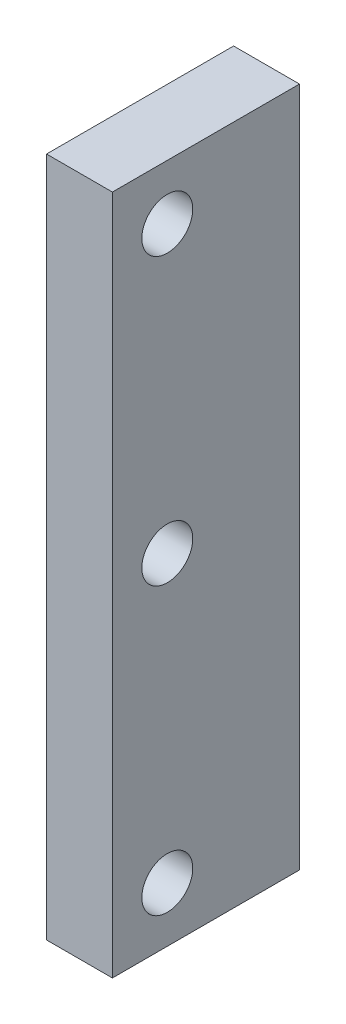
ISO-10303-21;
HEADER;
FILE_DESCRIPTION(('STEP AP214'),'2;1');
FILE_NAME('part.step','',(''),(''),'','','');
FILE_SCHEMA(('AUTOMOTIVE_DESIGN { 1 0 10303 214 1 1 1 1 }'));
ENDSEC;
DATA;
#1=APPLICATION_CONTEXT('core data for automotive mechanical design processes');
#2=APPLICATION_PROTOCOL_DEFINITION('international standard','automotive_design',2000,#1);
#3=PRODUCT_CONTEXT('',#1,'mechanical');
#4=PRODUCT('Part','Part','',(#3));
#5=PRODUCT_RELATED_PRODUCT_CATEGORY('part','',(#4));
#6=PRODUCT_DEFINITION_FORMATION('','',#4);
#7=PRODUCT_DEFINITION_CONTEXT('part definition',#1,'design');
#8=PRODUCT_DEFINITION('design','',#6,#7);
#9=PRODUCT_DEFINITION_SHAPE('','',#8);
#10=(LENGTH_UNIT() NAMED_UNIT(*) SI_UNIT(.MILLI.,.METRE.));
#11=(NAMED_UNIT(*) PLANE_ANGLE_UNIT() SI_UNIT($,.RADIAN.));
#12=(NAMED_UNIT(*) SI_UNIT($,.STERADIAN.) SOLID_ANGLE_UNIT());
#13=UNCERTAINTY_MEASURE_WITH_UNIT(LENGTH_MEASURE(1.E-05),#10,'distance_accuracy_value','');
#14=(GEOMETRIC_REPRESENTATION_CONTEXT(3) GLOBAL_UNCERTAINTY_ASSIGNED_CONTEXT((#13)) GLOBAL_UNIT_ASSIGNED_CONTEXT((#10,
#11,#12)) REPRESENTATION_CONTEXT('',''));
#15=CARTESIAN_POINT('',(0.,0.,0.));
#16=DIRECTION('',(0.,0.,1.));
#17=DIRECTION('',(1.,0.,0.));
#18=AXIS2_PLACEMENT_3D('',#15,#16,#17);
#19=CARTESIAN_POINT('',(0.,39.37,0.));
#20=DIRECTION('',(1.,0.,0.));
#21=DIRECTION('',(0.,0.,-1.));
#22=AXIS2_PLACEMENT_3D('',#19,#20,#21);
#23=PLANE('',#22);
#24=CARTESIAN_POINT('',(0.,19.685,-3.175));
#25=DIRECTION('',(-1.,0.,0.));
#26=DIRECTION('',(0.,0.,1.));
#27=AXIS2_PLACEMENT_3D('',#24,#25,#26);
#28=CIRCLE('',#27,1.47319999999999);
#29=CARTESIAN_POINT('',(0.,19.685,-1.70180000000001));
#30=VERTEX_POINT('',#29);
#31=EDGE_CURVE('E155',#30,#30,#28,.T.);
#32=ORIENTED_EDGE('',*,*,#31,.F.);
#33=EDGE_LOOP('',(#32));
#34=FACE_BOUND('',#33,.T.);
#35=CARTESIAN_POINT('',(0.,3.17499999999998,-3.17500000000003));
#36=DIRECTION('',(-1.,0.,0.));
#37=DIRECTION('',(0.,0.,1.));
#38=AXIS2_PLACEMENT_3D('',#35,#36,#37);
#39=CIRCLE('',#38,1.47319999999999);
#40=CARTESIAN_POINT('',(0.,3.17499999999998,-1.70180000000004));
#41=VERTEX_POINT('',#40);
#42=EDGE_CURVE('E96',#41,#41,#39,.T.);
#43=ORIENTED_EDGE('',*,*,#42,.F.);
#44=EDGE_LOOP('',(#43));
#45=FACE_BOUND('',#44,.T.);
#46=DIRECTION('',(0.,0.,1.));
#47=VECTOR('',#46,1.);
#48=CARTESIAN_POINT('',(0.,0.,0.));
#49=LINE('',#48,#47);
#50=CARTESIAN_POINT('',(0.,0.,-10.8204));
#51=VERTEX_POINT('',#50);
#52=CARTESIAN_POINT('',(0.,0.,0.));
#53=VERTEX_POINT('',#52);
#54=EDGE_CURVE('E76',#51,#53,#49,.T.);
#55=ORIENTED_EDGE('',*,*,#54,.T.);
#56=DIRECTION('',(0.,-1.,0.));
#57=VECTOR('',#56,1.);
#58=CARTESIAN_POINT('',(0.,39.37,0.));
#59=LINE('',#58,#57);
#60=CARTESIAN_POINT('',(0.,39.37,0.));
#61=VERTEX_POINT('',#60);
#62=EDGE_CURVE('E83',#61,#53,#59,.T.);
#63=ORIENTED_EDGE('',*,*,#62,.F.);
#64=DIRECTION('',(0.,0.,1.));
#65=VECTOR('',#64,1.);
#66=CARTESIAN_POINT('',(0.,39.37,0.));
#67=LINE('',#66,#65);
#68=CARTESIAN_POINT('',(0.,39.37,-10.8204));
#69=VERTEX_POINT('',#68);
#70=EDGE_CURVE('E103',#69,#61,#67,.T.);
#71=ORIENTED_EDGE('',*,*,#70,.F.);
#72=DIRECTION('',(0.,-1.,0.));
#73=VECTOR('',#72,1.);
#74=CARTESIAN_POINT('',(0.,39.37,-10.8204));
#75=LINE('',#74,#73);
#76=EDGE_CURVE('E92',#69,#51,#75,.T.);
#77=ORIENTED_EDGE('',*,*,#76,.T.);
#78=EDGE_LOOP('',(#55,#63,#71,#77));
#79=FACE_BOUND('',#78,.T.);
#80=CARTESIAN_POINT('',(0.,36.195,-3.175));
#81=DIRECTION('',(-1.,0.,0.));
#82=DIRECTION('',(0.,0.,1.));
#83=AXIS2_PLACEMENT_3D('',#80,#81,#82);
#84=CIRCLE('',#83,1.47319999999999);
#85=CARTESIAN_POINT('',(0.,36.195,-1.70180000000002));
#86=VERTEX_POINT('',#85);
#87=EDGE_CURVE('E11',#86,#86,#84,.T.);
#88=ORIENTED_EDGE('',*,*,#87,.F.);
#89=EDGE_LOOP('',(#88));
#90=FACE_BOUND('',#89,.T.);
#91=ADVANCED_FACE('F30',(#34,#45,#79,#90),#23,.F.);
#92=CARTESIAN_POINT('',(0.,39.37,0.));
#93=DIRECTION('',(0.,0.,-1.));
#94=DIRECTION('',(-1.,0.,0.));
#95=AXIS2_PLACEMENT_3D('',#92,#93,#94);
#96=PLANE('',#95);
#97=DIRECTION('',(1.,0.,0.));
#98=VECTOR('',#97,1.);
#99=CARTESIAN_POINT('',(0.,0.,0.));
#100=LINE('',#99,#98);
#101=CARTESIAN_POINT('',(3.81,0.,0.));
#102=VERTEX_POINT('',#101);
#103=EDGE_CURVE('E71',#53,#102,#100,.T.);
#104=ORIENTED_EDGE('',*,*,#103,.T.);
#105=DIRECTION('',(0.,-1.,0.));
#106=VECTOR('',#105,1.);
#107=CARTESIAN_POINT('',(3.81,39.37,0.));
#108=LINE('',#107,#106);
#109=CARTESIAN_POINT('',(3.81,39.37,0.));
#110=VERTEX_POINT('',#109);
#111=EDGE_CURVE('E88',#110,#102,#108,.T.);
#112=ORIENTED_EDGE('',*,*,#111,.F.);
#113=DIRECTION('',(1.,0.,0.));
#114=VECTOR('',#113,1.);
#115=CARTESIAN_POINT('',(0.,39.37,0.));
#116=LINE('',#115,#114);
#117=EDGE_CURVE('E85',#61,#110,#116,.T.);
#118=ORIENTED_EDGE('',*,*,#117,.F.);
#119=ORIENTED_EDGE('',*,*,#62,.T.);
#120=EDGE_LOOP('',(#104,#112,#118,#119));
#121=FACE_BOUND('',#120,.T.);
#122=ADVANCED_FACE('F84',(#121),#96,.F.);
#123=CARTESIAN_POINT('',(3.81,39.37,0.));
#124=DIRECTION('',(-1.,0.,0.));
#125=DIRECTION('',(0.,0.,1.));
#126=AXIS2_PLACEMENT_3D('',#123,#124,#125);
#127=PLANE('',#126);
#128=CARTESIAN_POINT('',(3.81,19.685,-3.175));
#129=DIRECTION('',(-1.,0.,0.));
#130=DIRECTION('',(0.,0.,1.));
#131=AXIS2_PLACEMENT_3D('',#128,#129,#130);
#132=CIRCLE('',#131,1.4732);
#133=CARTESIAN_POINT('',(3.81,19.685,-1.7018));
#134=VERTEX_POINT('',#133);
#135=EDGE_CURVE('E153',#134,#134,#132,.T.);
#136=ORIENTED_EDGE('',*,*,#135,.T.);
#137=EDGE_LOOP('',(#136));
#138=FACE_BOUND('',#137,.T.);
#139=CARTESIAN_POINT('',(3.80999999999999,3.17499999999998,-3.17500000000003));
#140=DIRECTION('',(-1.,0.,0.));
#141=DIRECTION('',(0.,0.,1.));
#142=AXIS2_PLACEMENT_3D('',#139,#140,#141);
#143=CIRCLE('',#142,1.4732);
#144=CARTESIAN_POINT('',(3.80999999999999,3.17499999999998,-1.70180000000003));
#145=VERTEX_POINT('',#144);
#146=EDGE_CURVE('E93',#145,#145,#143,.T.);
#147=ORIENTED_EDGE('',*,*,#146,.T.);
#148=EDGE_LOOP('',(#147));
#149=FACE_BOUND('',#148,.T.);
#150=DIRECTION('',(0.,0.,-1.));
#151=VECTOR('',#150,1.);
#152=CARTESIAN_POINT('',(3.81,0.,0.));
#153=LINE('',#152,#151);
#154=CARTESIAN_POINT('',(3.81,0.,-10.8204));
#155=VERTEX_POINT('',#154);
#156=EDGE_CURVE('E77',#102,#155,#153,.T.);
#157=ORIENTED_EDGE('',*,*,#156,.T.);
#158=DIRECTION('',(0.,-1.,0.));
#159=VECTOR('',#158,1.);
#160=CARTESIAN_POINT('',(3.81,39.37,-10.8204));
#161=LINE('',#160,#159);
#162=CARTESIAN_POINT('',(3.81,39.37,-10.8204));
#163=VERTEX_POINT('',#162);
#164=EDGE_CURVE('E109',#163,#155,#161,.T.);
#165=ORIENTED_EDGE('',*,*,#164,.F.);
#166=DIRECTION('',(0.,0.,-1.));
#167=VECTOR('',#166,1.);
#168=CARTESIAN_POINT('',(3.81,39.37,0.));
#169=LINE('',#168,#167);
#170=EDGE_CURVE('E50',#110,#163,#169,.T.);
#171=ORIENTED_EDGE('',*,*,#170,.F.);
#172=ORIENTED_EDGE('',*,*,#111,.T.);
#173=EDGE_LOOP('',(#157,#165,#171,#172));
#174=FACE_BOUND('',#173,.T.);
#175=CARTESIAN_POINT('',(3.81,36.195,-3.175));
#176=DIRECTION('',(-1.,0.,0.));
#177=DIRECTION('',(0.,0.,1.));
#178=AXIS2_PLACEMENT_3D('',#175,#176,#177);
#179=CIRCLE('',#178,1.4732);
#180=CARTESIAN_POINT('',(3.81,36.195,-1.70180000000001));
#181=VERTEX_POINT('',#180);
#182=EDGE_CURVE('E38',#181,#181,#179,.T.);
#183=ORIENTED_EDGE('',*,*,#182,.T.);
#184=EDGE_LOOP('',(#183));
#185=FACE_BOUND('',#184,.T.);
#186=ADVANCED_FACE('F115',(#138,#149,#174,#185),#127,.F.);
#187=CARTESIAN_POINT('',(0.,39.37,-10.8204));
#188=DIRECTION('',(0.,0.,1.));
#189=DIRECTION('',(1.,0.,0.));
#190=AXIS2_PLACEMENT_3D('',#187,#188,#189);
#191=PLANE('',#190);
#192=DIRECTION('',(-1.,0.,0.));
#193=VECTOR('',#192,1.);
#194=CARTESIAN_POINT('',(0.,0.,-10.8204));
#195=LINE('',#194,#193);
#196=EDGE_CURVE('E101',#155,#51,#195,.T.);
#197=ORIENTED_EDGE('',*,*,#196,.T.);
#198=ORIENTED_EDGE('',*,*,#76,.F.);
#199=DIRECTION('',(-1.,0.,0.));
#200=VECTOR('',#199,1.);
#201=CARTESIAN_POINT('',(0.,39.37,-10.8204));
#202=LINE('',#201,#200);
#203=EDGE_CURVE('E45',#163,#69,#202,.T.);
#204=ORIENTED_EDGE('',*,*,#203,.F.);
#205=ORIENTED_EDGE('',*,*,#164,.T.);
#206=EDGE_LOOP('',(#197,#198,#204,#205));
#207=FACE_BOUND('',#206,.T.);
#208=ADVANCED_FACE('F132',(#207),#191,.F.);
#209=CARTESIAN_POINT('',(0.,39.37,0.));
#210=DIRECTION('',(0.,-1.,0.));
#211=DIRECTION('',(0.,0.,-1.));
#212=AXIS2_PLACEMENT_3D('',#209,#210,#211);
#213=PLANE('',#212);
#214=ORIENTED_EDGE('',*,*,#70,.T.);
#215=ORIENTED_EDGE('',*,*,#117,.T.);
#216=ORIENTED_EDGE('',*,*,#170,.T.);
#217=ORIENTED_EDGE('',*,*,#203,.T.);
#218=EDGE_LOOP('',(#214,#215,#216,#217));
#219=FACE_BOUND('',#218,.T.);
#220=ADVANCED_FACE('F136',(#219),#213,.F.);
#221=CARTESIAN_POINT('',(0.,0.,0.));
#222=DIRECTION('',(0.,-1.,0.));
#223=DIRECTION('',(0.,0.,-1.));
#224=AXIS2_PLACEMENT_3D('',#221,#222,#223);
#225=PLANE('',#224);
#226=ORIENTED_EDGE('',*,*,#54,.F.);
#227=ORIENTED_EDGE('',*,*,#196,.F.);
#228=ORIENTED_EDGE('',*,*,#156,.F.);
#229=ORIENTED_EDGE('',*,*,#103,.F.);
#230=EDGE_LOOP('',(#226,#227,#228,#229));
#231=FACE_BOUND('',#230,.T.);
#232=ADVANCED_FACE('F73',(#231),#225,.T.);
#233=CARTESIAN_POINT('',(0.,3.17499999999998,-3.17500000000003));
#234=DIRECTION('',(-1.,0.,0.));
#235=DIRECTION('',(0.,0.,1.));
#236=AXIS2_PLACEMENT_3D('',#233,#234,#235);
#237=CYLINDRICAL_SURFACE('',#236,1.47319999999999);
#238=ORIENTED_EDGE('',*,*,#146,.F.);
#239=EDGE_LOOP('',(#238));
#240=FACE_BOUND('',#239,.T.);
#241=ORIENTED_EDGE('',*,*,#42,.T.);
#242=EDGE_LOOP('',(#241));
#243=FACE_BOUND('',#242,.T.);
#244=ADVANCED_FACE('F142',(#240,#243),#237,.F.);
#245=CARTESIAN_POINT('',(0.,19.685,-3.175));
#246=DIRECTION('',(-1.,0.,0.));
#247=DIRECTION('',(0.,0.,1.));
#248=AXIS2_PLACEMENT_3D('',#245,#246,#247);
#249=CYLINDRICAL_SURFACE('',#248,1.47319999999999);
#250=ORIENTED_EDGE('',*,*,#135,.F.);
#251=EDGE_LOOP('',(#250));
#252=FACE_BOUND('',#251,.T.);
#253=ORIENTED_EDGE('',*,*,#31,.T.);
#254=EDGE_LOOP('',(#253));
#255=FACE_BOUND('',#254,.T.);
#256=ADVANCED_FACE('F119',(#252,#255),#249,.F.);
#257=CARTESIAN_POINT('',(0.,36.195,-3.175));
#258=DIRECTION('',(-1.,0.,0.));
#259=DIRECTION('',(0.,0.,1.));
#260=AXIS2_PLACEMENT_3D('',#257,#258,#259);
#261=CYLINDRICAL_SURFACE('',#260,1.47319999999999);
#262=ORIENTED_EDGE('',*,*,#182,.F.);
#263=EDGE_LOOP('',(#262));
#264=FACE_BOUND('',#263,.T.);
#265=ORIENTED_EDGE('',*,*,#87,.T.);
#266=EDGE_LOOP('',(#265));
#267=FACE_BOUND('',#266,.T.);
#268=ADVANCED_FACE('F32',(#264,#267),#261,.F.);
#269=CLOSED_SHELL('',(#91,#122,#186,#208,#220,#232,#244,#256,#268));
#270=MANIFOLD_SOLID_BREP('B2',#269);
#271=ADVANCED_BREP_SHAPE_REPRESENTATION('',(#18,#270),#14);
#272=SHAPE_DEFINITION_REPRESENTATION(#9,#271);
ENDSEC;
END-ISO-10303-21;
